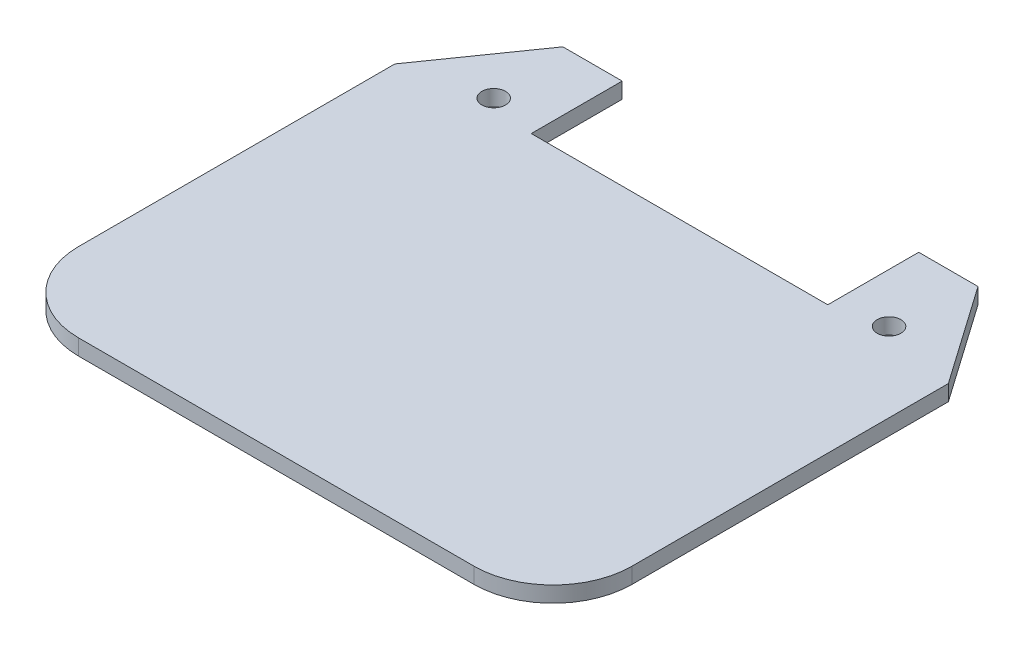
ISO-10303-21;
HEADER;
FILE_DESCRIPTION(('STEP AP214'),'2;1');
FILE_NAME('part.step','',(''),(''),'','','');
FILE_SCHEMA(('AUTOMOTIVE_DESIGN { 1 0 10303 214 1 1 1 1 }'));
ENDSEC;
DATA;
#1=APPLICATION_CONTEXT('core data for automotive mechanical design processes');
#2=APPLICATION_PROTOCOL_DEFINITION('international standard','automotive_design',2000,#1);
#3=PRODUCT_CONTEXT('',#1,'mechanical');
#4=PRODUCT('Part','Part','',(#3));
#5=PRODUCT_RELATED_PRODUCT_CATEGORY('part','',(#4));
#6=PRODUCT_DEFINITION_FORMATION('','',#4);
#7=PRODUCT_DEFINITION_CONTEXT('part definition',#1,'design');
#8=PRODUCT_DEFINITION('design','',#6,#7);
#9=PRODUCT_DEFINITION_SHAPE('','',#8);
#10=(LENGTH_UNIT() NAMED_UNIT(*) SI_UNIT(.MILLI.,.METRE.));
#11=(NAMED_UNIT(*) PLANE_ANGLE_UNIT() SI_UNIT($,.RADIAN.));
#12=(NAMED_UNIT(*) SI_UNIT($,.STERADIAN.) SOLID_ANGLE_UNIT());
#13=UNCERTAINTY_MEASURE_WITH_UNIT(LENGTH_MEASURE(1.E-05),#10,'distance_accuracy_value','');
#14=(GEOMETRIC_REPRESENTATION_CONTEXT(3) GLOBAL_UNCERTAINTY_ASSIGNED_CONTEXT((#13)) GLOBAL_UNIT_ASSIGNED_CONTEXT((#10,
#11,#12)) REPRESENTATION_CONTEXT('',''));
#15=CARTESIAN_POINT('',(0.,0.,0.));
#16=DIRECTION('',(0.,0.,1.));
#17=DIRECTION('',(1.,0.,0.));
#18=AXIS2_PLACEMENT_3D('',#15,#16,#17);
#19=CARTESIAN_POINT('',(5.24948115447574,0.4,-6.25));
#20=DIRECTION('',(0.,0.,1.));
#21=DIRECTION('',(1.,0.,0.));
#22=AXIS2_PLACEMENT_3D('',#19,#20,#21);
#23=PLANE('',#22);
#24=DIRECTION('',(-1.,0.,0.));
#25=VECTOR('',#24,1.);
#26=CARTESIAN_POINT('',(5.24948115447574,0.,-6.25));
#27=LINE('',#26,#25);
#28=CARTESIAN_POINT('',(5.24948115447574,0.,-6.25));
#29=VERTEX_POINT('',#28);
#30=CARTESIAN_POINT('',(3.75,0.,-6.25));
#31=VERTEX_POINT('',#30);
#32=EDGE_CURVE('E147',#29,#31,#27,.T.);
#33=ORIENTED_EDGE('',*,*,#32,.T.);
#34=DIRECTION('',(0.,1.,0.));
#35=VECTOR('',#34,1.);
#36=CARTESIAN_POINT('',(3.75,-9.6,-6.25));
#37=LINE('',#36,#35);
#38=CARTESIAN_POINT('',(3.75,0.4,-6.25));
#39=VERTEX_POINT('',#38);
#40=EDGE_CURVE('E131',#31,#39,#37,.T.);
#41=ORIENTED_EDGE('',*,*,#40,.T.);
#42=DIRECTION('',(-1.,0.,0.));
#43=VECTOR('',#42,1.);
#44=CARTESIAN_POINT('',(5.24948115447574,0.4,-6.25));
#45=LINE('',#44,#43);
#46=CARTESIAN_POINT('',(5.24948115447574,0.4,-6.25));
#47=VERTEX_POINT('',#46);
#48=EDGE_CURVE('E145',#47,#39,#45,.T.);
#49=ORIENTED_EDGE('',*,*,#48,.F.);
#50=DIRECTION('',(0.,-1.,0.));
#51=VECTOR('',#50,1.);
#52=CARTESIAN_POINT('',(5.24948115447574,0.4,-6.25));
#53=LINE('',#52,#51);
#54=EDGE_CURVE('E183',#47,#29,#53,.T.);
#55=ORIENTED_EDGE('',*,*,#54,.T.);
#56=EDGE_LOOP('',(#33,#41,#49,#55));
#57=FACE_BOUND('',#56,.T.);
#58=ADVANCED_FACE('F37',(#57),#23,.F.);
#59=CARTESIAN_POINT('',(-7.,0.4,-3.75));
#60=DIRECTION('',(1.,0.,0.));
#61=DIRECTION('',(0.,0.,-1.));
#62=AXIS2_PLACEMENT_3D('',#59,#60,#61);
#63=PLANE('',#62);
#64=DIRECTION('',(0.,0.,1.));
#65=VECTOR('',#64,1.);
#66=CARTESIAN_POINT('',(-7.,0.,-3.75));
#67=LINE('',#66,#65);
#68=CARTESIAN_POINT('',(-7.,0.,-3.75));
#69=VERTEX_POINT('',#68);
#70=CARTESIAN_POINT('',(-7.,0.,4.25));
#71=VERTEX_POINT('',#70);
#72=EDGE_CURVE('E163',#69,#71,#67,.T.);
#73=ORIENTED_EDGE('',*,*,#72,.T.);
#74=DIRECTION('',(0.,-1.,0.));
#75=VECTOR('',#74,1.);
#76=CARTESIAN_POINT('',(-7.,0.4,4.25));
#77=LINE('',#76,#75);
#78=CARTESIAN_POINT('',(-7.,0.4,4.25));
#79=VERTEX_POINT('',#78);
#80=EDGE_CURVE('E60',#71,#79,#77,.F.);
#81=ORIENTED_EDGE('',*,*,#80,.T.);
#82=DIRECTION('',(0.,0.,1.));
#83=VECTOR('',#82,1.);
#84=CARTESIAN_POINT('',(-7.,0.4,-3.75));
#85=LINE('',#84,#83);
#86=CARTESIAN_POINT('',(-7.,0.4,-3.75));
#87=VERTEX_POINT('',#86);
#88=EDGE_CURVE('E177',#87,#79,#85,.T.);
#89=ORIENTED_EDGE('',*,*,#88,.F.);
#90=DIRECTION('',(0.,-1.,0.));
#91=VECTOR('',#90,1.);
#92=CARTESIAN_POINT('',(-7.,0.4,-3.75));
#93=LINE('',#92,#91);
#94=EDGE_CURVE('E158',#87,#69,#93,.T.);
#95=ORIENTED_EDGE('',*,*,#94,.T.);
#96=EDGE_LOOP('',(#73,#81,#89,#95));
#97=FACE_BOUND('',#96,.T.);
#98=ADVANCED_FACE('F227',(#97),#63,.F.);
#99=CARTESIAN_POINT('',(-7.,0.4,6.25));
#100=DIRECTION('',(0.,0.,-1.));
#101=DIRECTION('',(-1.,0.,0.));
#102=AXIS2_PLACEMENT_3D('',#99,#100,#101);
#103=PLANE('',#102);
#104=DIRECTION('',(1.,0.,0.));
#105=VECTOR('',#104,1.);
#106=CARTESIAN_POINT('',(-7.,0.4,6.25));
#107=LINE('',#106,#105);
#108=CARTESIAN_POINT('',(-5.,0.4,6.25));
#109=VERTEX_POINT('',#108);
#110=CARTESIAN_POINT('',(5.,0.4,6.25));
#111=VERTEX_POINT('',#110);
#112=EDGE_CURVE('E213',#109,#111,#107,.T.);
#113=ORIENTED_EDGE('',*,*,#112,.F.);
#114=DIRECTION('',(0.,-1.,0.));
#115=VECTOR('',#114,1.);
#116=CARTESIAN_POINT('',(-5.,0.4,6.25));
#117=LINE('',#116,#115);
#118=CARTESIAN_POINT('',(-5.,0.,6.25));
#119=VERTEX_POINT('',#118);
#120=EDGE_CURVE('E203',#109,#119,#117,.T.);
#121=ORIENTED_EDGE('',*,*,#120,.T.);
#122=DIRECTION('',(1.,0.,0.));
#123=VECTOR('',#122,1.);
#124=CARTESIAN_POINT('',(-7.,0.,6.25));
#125=LINE('',#124,#123);
#126=CARTESIAN_POINT('',(5.,0.,6.25));
#127=VERTEX_POINT('',#126);
#128=EDGE_CURVE('E165',#119,#127,#125,.T.);
#129=ORIENTED_EDGE('',*,*,#128,.T.);
#130=DIRECTION('',(0.,-1.,0.));
#131=VECTOR('',#130,1.);
#132=CARTESIAN_POINT('',(5.,0.4,6.25));
#133=LINE('',#132,#131);
#134=EDGE_CURVE('E196',#127,#111,#133,.F.);
#135=ORIENTED_EDGE('',*,*,#134,.T.);
#136=EDGE_LOOP('',(#113,#121,#129,#135));
#137=FACE_BOUND('',#136,.T.);
#138=ADVANCED_FACE('F217',(#137),#103,.F.);
#139=CARTESIAN_POINT('',(7.,0.4,-3.75000000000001));
#140=DIRECTION('',(-1.,0.,0.));
#141=DIRECTION('',(0.,0.,1.));
#142=AXIS2_PLACEMENT_3D('',#139,#140,#141);
#143=PLANE('',#142);
#144=DIRECTION('',(0.,0.,-1.));
#145=VECTOR('',#144,1.);
#146=CARTESIAN_POINT('',(7.,0.4,-3.75000000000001));
#147=LINE('',#146,#145);
#148=CARTESIAN_POINT('',(7.,0.4,4.25));
#149=VERTEX_POINT('',#148);
#150=CARTESIAN_POINT('',(7.,0.4,-3.75000000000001));
#151=VERTEX_POINT('',#150);
#152=EDGE_CURVE('E220',#149,#151,#147,.T.);
#153=ORIENTED_EDGE('',*,*,#152,.F.);
#154=DIRECTION('',(0.,-1.,0.));
#155=VECTOR('',#154,1.);
#156=CARTESIAN_POINT('',(7.,0.4,4.25));
#157=LINE('',#156,#155);
#158=CARTESIAN_POINT('',(7.,0.,4.25));
#159=VERTEX_POINT('',#158);
#160=EDGE_CURVE('E11',#149,#159,#157,.T.);
#161=ORIENTED_EDGE('',*,*,#160,.T.);
#162=DIRECTION('',(0.,0.,-1.));
#163=VECTOR('',#162,1.);
#164=CARTESIAN_POINT('',(7.,0.,-3.75000000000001));
#165=LINE('',#164,#163);
#166=CARTESIAN_POINT('',(7.,0.,-3.75000000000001));
#167=VERTEX_POINT('',#166);
#168=EDGE_CURVE('E169',#159,#167,#165,.T.);
#169=ORIENTED_EDGE('',*,*,#168,.T.);
#170=DIRECTION('',(0.,-1.,0.));
#171=VECTOR('',#170,1.);
#172=CARTESIAN_POINT('',(7.,0.4,-3.75000000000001));
#173=LINE('',#172,#171);
#174=EDGE_CURVE('E185',#151,#167,#173,.T.);
#175=ORIENTED_EDGE('',*,*,#174,.F.);
#176=EDGE_LOOP('',(#153,#161,#169,#175));
#177=FACE_BOUND('',#176,.T.);
#178=ADVANCED_FACE('F249',(#177),#143,.F.);
#179=CARTESIAN_POINT('',(7.,0.4,-3.75000000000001));
#180=DIRECTION('',(-0.819152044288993,0.,0.573576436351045));
#181=DIRECTION('',(0.573576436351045,0.,0.819152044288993));
#182=AXIS2_PLACEMENT_3D('',#179,#180,#181);
#183=PLANE('',#182);
#184=DIRECTION('',(-0.573576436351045,0.,-0.819152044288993));
#185=VECTOR('',#184,1.);
#186=CARTESIAN_POINT('',(7.,0.,-3.75000000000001));
#187=LINE('',#186,#185);
#188=EDGE_CURVE('E171',#167,#29,#187,.T.);
#189=ORIENTED_EDGE('',*,*,#188,.T.);
#190=ORIENTED_EDGE('',*,*,#54,.F.);
#191=DIRECTION('',(-0.573576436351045,0.,-0.819152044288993));
#192=VECTOR('',#191,1.);
#193=CARTESIAN_POINT('',(7.,0.4,-3.75000000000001));
#194=LINE('',#193,#192);
#195=EDGE_CURVE('E153',#151,#47,#194,.T.);
#196=ORIENTED_EDGE('',*,*,#195,.F.);
#197=ORIENTED_EDGE('',*,*,#174,.T.);
#198=EDGE_LOOP('',(#189,#190,#196,#197));
#199=FACE_BOUND('',#198,.T.);
#200=ADVANCED_FACE('F253',(#199),#183,.F.);
#201=CARTESIAN_POINT('',(-3.75,0.4,-6.25));
#202=VERTEX_POINT('',#201);
#203=CARTESIAN_POINT('',(-5.24948115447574,0.4,-6.25));
#204=VERTEX_POINT('',#203);
#205=EDGE_CURVE('E156',#202,#204,#45,.T.);
#206=ORIENTED_EDGE('',*,*,#205,.F.);
#207=DIRECTION('',(0.,1.,0.));
#208=VECTOR('',#207,1.);
#209=CARTESIAN_POINT('',(-3.75,-9.6,-6.25));
#210=LINE('',#209,#208);
#211=CARTESIAN_POINT('',(-3.75,0.,-6.25));
#212=VERTEX_POINT('',#211);
#213=EDGE_CURVE('E148',#212,#202,#210,.T.);
#214=ORIENTED_EDGE('',*,*,#213,.F.);
#215=CARTESIAN_POINT('',(-5.24948115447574,0.,-6.25));
#216=VERTEX_POINT('',#215);
#217=EDGE_CURVE('E173',#212,#216,#27,.T.);
#218=ORIENTED_EDGE('',*,*,#217,.T.);
#219=DIRECTION('',(0.,-1.,0.));
#220=VECTOR('',#219,1.);
#221=CARTESIAN_POINT('',(-5.24948115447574,0.4,-6.25));
#222=LINE('',#221,#220);
#223=EDGE_CURVE('E180',#204,#216,#222,.T.);
#224=ORIENTED_EDGE('',*,*,#223,.F.);
#225=EDGE_LOOP('',(#206,#214,#218,#224));
#226=FACE_BOUND('',#225,.T.);
#227=ADVANCED_FACE('F237',(#226),#23,.F.);
#228=CARTESIAN_POINT('',(-5.24948115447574,0.4,-6.25));
#229=DIRECTION('',(0.819152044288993,0.,0.573576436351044));
#230=DIRECTION('',(0.573576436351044,0.,-0.819152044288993));
#231=AXIS2_PLACEMENT_3D('',#228,#229,#230);
#232=PLANE('',#231);
#233=DIRECTION('',(-0.573576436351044,0.,0.819152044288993));
#234=VECTOR('',#233,1.);
#235=CARTESIAN_POINT('',(-5.24948115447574,0.,-6.25));
#236=LINE('',#235,#234);
#237=EDGE_CURVE('E175',#216,#69,#236,.T.);
#238=ORIENTED_EDGE('',*,*,#237,.T.);
#239=ORIENTED_EDGE('',*,*,#94,.F.);
#240=DIRECTION('',(-0.573576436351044,0.,0.819152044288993));
#241=VECTOR('',#240,1.);
#242=CARTESIAN_POINT('',(-5.24948115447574,0.4,-6.25));
#243=LINE('',#242,#241);
#244=EDGE_CURVE('E155',#204,#87,#243,.T.);
#245=ORIENTED_EDGE('',*,*,#244,.F.);
#246=ORIENTED_EDGE('',*,*,#223,.T.);
#247=EDGE_LOOP('',(#238,#239,#245,#246));
#248=FACE_BOUND('',#247,.T.);
#249=ADVANCED_FACE('F231',(#248),#232,.F.);
#250=CARTESIAN_POINT('',(0.,0.4,0.));
#251=DIRECTION('',(0.,1.,0.));
#252=DIRECTION('',(0.,0.,1.));
#253=AXIS2_PLACEMENT_3D('',#250,#251,#252);
#254=PLANE('',#253);
#255=CARTESIAN_POINT('',(5.,0.4,-4.25));
#256=DIRECTION('',(0.,1.,0.));
#257=DIRECTION('',(0.,0.,1.));
#258=AXIS2_PLACEMENT_3D('',#255,#256,#257);
#259=CIRCLE('',#258,0.3);
#260=CARTESIAN_POINT('',(5.,0.4,-3.95));
#261=VERTEX_POINT('',#260);
#262=EDGE_CURVE('E260',#261,#261,#259,.T.);
#263=ORIENTED_EDGE('',*,*,#262,.F.);
#264=EDGE_LOOP('',(#263));
#265=FACE_BOUND('',#264,.T.);
#266=CARTESIAN_POINT('',(-5.,0.4,-4.25));
#267=DIRECTION('',(0.,1.,0.));
#268=DIRECTION('',(0.,0.,1.));
#269=AXIS2_PLACEMENT_3D('',#266,#267,#268);
#270=CIRCLE('',#269,0.3);
#271=CARTESIAN_POINT('',(-5.,0.4,-3.95));
#272=VERTEX_POINT('',#271);
#273=EDGE_CURVE('E139',#272,#272,#270,.T.);
#274=ORIENTED_EDGE('',*,*,#273,.F.);
#275=EDGE_LOOP('',(#274));
#276=FACE_BOUND('',#275,.T.);
#277=ORIENTED_EDGE('',*,*,#88,.T.);
#278=CARTESIAN_POINT('',(-5.,0.4,4.25));
#279=DIRECTION('',(0.,1.,0.));
#280=DIRECTION('',(0.,0.,1.));
#281=AXIS2_PLACEMENT_3D('',#278,#279,#280);
#282=CIRCLE('',#281,2.);
#283=EDGE_CURVE('E45',#79,#109,#282,.T.);
#284=ORIENTED_EDGE('',*,*,#283,.T.);
#285=ORIENTED_EDGE('',*,*,#112,.T.);
#286=CARTESIAN_POINT('',(5.,0.4,4.25));
#287=DIRECTION('',(0.,1.,0.));
#288=DIRECTION('',(0.,0.,1.));
#289=AXIS2_PLACEMENT_3D('',#286,#287,#288);
#290=CIRCLE('',#289,2.);
#291=EDGE_CURVE('E52',#111,#149,#290,.T.);
#292=ORIENTED_EDGE('',*,*,#291,.T.);
#293=ORIENTED_EDGE('',*,*,#152,.T.);
#294=ORIENTED_EDGE('',*,*,#195,.T.);
#295=ORIENTED_EDGE('',*,*,#48,.T.);
#296=DIRECTION('',(0.,0.,-1.));
#297=VECTOR('',#296,1.);
#298=CARTESIAN_POINT('',(3.75,0.4,-6.25));
#299=LINE('',#298,#297);
#300=CARTESIAN_POINT('',(3.75,0.4,-3.95));
#301=VERTEX_POINT('',#300);
#302=EDGE_CURVE('E128',#301,#39,#299,.T.);
#303=ORIENTED_EDGE('',*,*,#302,.F.);
#304=DIRECTION('',(1.,0.,0.));
#305=VECTOR('',#304,1.);
#306=CARTESIAN_POINT('',(3.75,0.4,-3.95));
#307=LINE('',#306,#305);
#308=CARTESIAN_POINT('',(-3.75,0.4,-3.95));
#309=VERTEX_POINT('',#308);
#310=EDGE_CURVE('E149',#309,#301,#307,.T.);
#311=ORIENTED_EDGE('',*,*,#310,.F.);
#312=DIRECTION('',(0.,0.,1.));
#313=VECTOR('',#312,1.);
#314=CARTESIAN_POINT('',(-3.75,0.4,-6.25));
#315=LINE('',#314,#313);
#316=EDGE_CURVE('E138',#202,#309,#315,.T.);
#317=ORIENTED_EDGE('',*,*,#316,.F.);
#318=ORIENTED_EDGE('',*,*,#205,.T.);
#319=ORIENTED_EDGE('',*,*,#244,.T.);
#320=EDGE_LOOP('',(#277,#284,#285,#292,#293,#294,#295,#303,#311,#317,#318,#319));
#321=FACE_BOUND('',#320,.T.);
#322=ADVANCED_FACE('F151',(#265,#276,#321),#254,.T.);
#323=CARTESIAN_POINT('',(0.,0.,0.));
#324=DIRECTION('',(0.,1.,0.));
#325=DIRECTION('',(0.,0.,1.));
#326=AXIS2_PLACEMENT_3D('',#323,#324,#325);
#327=PLANE('',#326);
#328=CARTESIAN_POINT('',(5.,0.,-4.25));
#329=DIRECTION('',(0.,1.,0.));
#330=DIRECTION('',(0.,0.,1.));
#331=AXIS2_PLACEMENT_3D('',#328,#329,#330);
#332=CIRCLE('',#331,0.3);
#333=CARTESIAN_POINT('',(5.,0.,-3.95));
#334=VERTEX_POINT('',#333);
#335=EDGE_CURVE('E166',#334,#334,#332,.T.);
#336=ORIENTED_EDGE('',*,*,#335,.T.);
#337=EDGE_LOOP('',(#336));
#338=FACE_BOUND('',#337,.T.);
#339=CARTESIAN_POINT('',(-5.,0.,-4.25));
#340=DIRECTION('',(0.,1.,0.));
#341=DIRECTION('',(0.,0.,1.));
#342=AXIS2_PLACEMENT_3D('',#339,#340,#341);
#343=CIRCLE('',#342,0.3);
#344=CARTESIAN_POINT('',(-5.,0.,-3.95));
#345=VERTEX_POINT('',#344);
#346=EDGE_CURVE('E197',#345,#345,#343,.T.);
#347=ORIENTED_EDGE('',*,*,#346,.T.);
#348=EDGE_LOOP('',(#347));
#349=FACE_BOUND('',#348,.T.);
#350=ORIENTED_EDGE('',*,*,#128,.F.);
#351=CARTESIAN_POINT('',(-5.,0.,4.25));
#352=DIRECTION('',(0.,1.,0.));
#353=DIRECTION('',(0.,0.,1.));
#354=AXIS2_PLACEMENT_3D('',#351,#352,#353);
#355=CIRCLE('',#354,2.);
#356=EDGE_CURVE('E208',#119,#71,#355,.F.);
#357=ORIENTED_EDGE('',*,*,#356,.T.);
#358=ORIENTED_EDGE('',*,*,#72,.F.);
#359=ORIENTED_EDGE('',*,*,#237,.F.);
#360=ORIENTED_EDGE('',*,*,#217,.F.);
#361=DIRECTION('',(0.,0.,1.));
#362=VECTOR('',#361,1.);
#363=CARTESIAN_POINT('',(-3.75,0.,0.));
#364=LINE('',#363,#362);
#365=CARTESIAN_POINT('',(-3.75,0.,-3.95));
#366=VERTEX_POINT('',#365);
#367=EDGE_CURVE('E188',#212,#366,#364,.T.);
#368=ORIENTED_EDGE('',*,*,#367,.T.);
#369=DIRECTION('',(1.,0.,0.));
#370=VECTOR('',#369,1.);
#371=CARTESIAN_POINT('',(0.,0.,-3.95));
#372=LINE('',#371,#370);
#373=CARTESIAN_POINT('',(3.75,0.,-3.95));
#374=VERTEX_POINT('',#373);
#375=EDGE_CURVE('E191',#366,#374,#372,.T.);
#376=ORIENTED_EDGE('',*,*,#375,.T.);
#377=DIRECTION('',(0.,0.,-1.));
#378=VECTOR('',#377,1.);
#379=CARTESIAN_POINT('',(3.75,0.,0.));
#380=LINE('',#379,#378);
#381=EDGE_CURVE('E194',#374,#31,#380,.T.);
#382=ORIENTED_EDGE('',*,*,#381,.T.);
#383=ORIENTED_EDGE('',*,*,#32,.F.);
#384=ORIENTED_EDGE('',*,*,#188,.F.);
#385=ORIENTED_EDGE('',*,*,#168,.F.);
#386=CARTESIAN_POINT('',(5.,0.,4.25));
#387=DIRECTION('',(0.,1.,0.));
#388=DIRECTION('',(0.,0.,1.));
#389=AXIS2_PLACEMENT_3D('',#386,#387,#388);
#390=CIRCLE('',#389,2.);
#391=EDGE_CURVE('E206',#159,#127,#390,.F.);
#392=ORIENTED_EDGE('',*,*,#391,.T.);
#393=EDGE_LOOP('',(#350,#357,#358,#359,#360,#368,#376,#382,#383,#384,#385,#392));
#394=FACE_BOUND('',#393,.T.);
#395=ADVANCED_FACE('F225',(#338,#349,#394),#327,.F.);
#396=CARTESIAN_POINT('',(3.75,-9.6,-6.25));
#397=DIRECTION('',(1.,0.,0.));
#398=DIRECTION('',(0.,0.,-1.));
#399=AXIS2_PLACEMENT_3D('',#396,#397,#398);
#400=PLANE('',#399);
#401=DIRECTION('',(0.,1.,0.));
#402=VECTOR('',#401,1.);
#403=CARTESIAN_POINT('',(3.75,-9.6,-3.95));
#404=LINE('',#403,#402);
#405=EDGE_CURVE('E134',#374,#301,#404,.T.);
#406=ORIENTED_EDGE('',*,*,#405,.T.);
#407=ORIENTED_EDGE('',*,*,#302,.T.);
#408=ORIENTED_EDGE('',*,*,#40,.F.);
#409=ORIENTED_EDGE('',*,*,#381,.F.);
#410=EDGE_LOOP('',(#406,#407,#408,#409));
#411=FACE_BOUND('',#410,.T.);
#412=ADVANCED_FACE('F130',(#411),#400,.F.);
#413=CARTESIAN_POINT('',(3.75,-9.6,-3.95));
#414=DIRECTION('',(0.,0.,1.));
#415=DIRECTION('',(1.,0.,0.));
#416=AXIS2_PLACEMENT_3D('',#413,#414,#415);
#417=PLANE('',#416);
#418=DIRECTION('',(0.,1.,0.));
#419=VECTOR('',#418,1.);
#420=CARTESIAN_POINT('',(-3.75,-9.6,-3.95));
#421=LINE('',#420,#419);
#422=EDGE_CURVE('E241',#366,#309,#421,.T.);
#423=ORIENTED_EDGE('',*,*,#422,.T.);
#424=ORIENTED_EDGE('',*,*,#310,.T.);
#425=ORIENTED_EDGE('',*,*,#405,.F.);
#426=ORIENTED_EDGE('',*,*,#375,.F.);
#427=EDGE_LOOP('',(#423,#424,#425,#426));
#428=FACE_BOUND('',#427,.T.);
#429=ADVANCED_FACE('F256',(#428),#417,.F.);
#430=CARTESIAN_POINT('',(-3.75,-9.6,-6.25));
#431=DIRECTION('',(-1.,0.,0.));
#432=DIRECTION('',(0.,0.,1.));
#433=AXIS2_PLACEMENT_3D('',#430,#431,#432);
#434=PLANE('',#433);
#435=ORIENTED_EDGE('',*,*,#213,.T.);
#436=ORIENTED_EDGE('',*,*,#316,.T.);
#437=ORIENTED_EDGE('',*,*,#422,.F.);
#438=ORIENTED_EDGE('',*,*,#367,.F.);
#439=EDGE_LOOP('',(#435,#436,#437,#438));
#440=FACE_BOUND('',#439,.T.);
#441=ADVANCED_FACE('F310',(#440),#434,.F.);
#442=CARTESIAN_POINT('',(-5.,-9.6,-4.25));
#443=DIRECTION('',(0.,1.,0.));
#444=DIRECTION('',(0.,0.,1.));
#445=AXIS2_PLACEMENT_3D('',#442,#443,#444);
#446=CYLINDRICAL_SURFACE('',#445,0.3);
#447=ORIENTED_EDGE('',*,*,#273,.T.);
#448=EDGE_LOOP('',(#447));
#449=FACE_BOUND('',#448,.T.);
#450=ORIENTED_EDGE('',*,*,#346,.F.);
#451=EDGE_LOOP('',(#450));
#452=FACE_BOUND('',#451,.T.);
#453=ADVANCED_FACE('F266',(#449,#452),#446,.F.);
#454=CARTESIAN_POINT('',(5.,-9.6,-4.25));
#455=DIRECTION('',(0.,1.,0.));
#456=DIRECTION('',(0.,0.,1.));
#457=AXIS2_PLACEMENT_3D('',#454,#455,#456);
#458=CYLINDRICAL_SURFACE('',#457,0.3);
#459=ORIENTED_EDGE('',*,*,#262,.T.);
#460=EDGE_LOOP('',(#459));
#461=FACE_BOUND('',#460,.T.);
#462=ORIENTED_EDGE('',*,*,#335,.F.);
#463=EDGE_LOOP('',(#462));
#464=FACE_BOUND('',#463,.T.);
#465=ADVANCED_FACE('F299',(#461,#464),#458,.F.);
#466=CARTESIAN_POINT('',(-5.,0.4,4.25));
#467=DIRECTION('',(0.,-1.,0.));
#468=DIRECTION('',(0.,0.,-1.));
#469=AXIS2_PLACEMENT_3D('',#466,#467,#468);
#470=CYLINDRICAL_SURFACE('',#469,2.);
#471=ORIENTED_EDGE('',*,*,#283,.F.);
#472=ORIENTED_EDGE('',*,*,#80,.F.);
#473=ORIENTED_EDGE('',*,*,#356,.F.);
#474=ORIENTED_EDGE('',*,*,#120,.F.);
#475=EDGE_LOOP('',(#471,#472,#473,#474));
#476=FACE_BOUND('',#475,.T.);
#477=ADVANCED_FACE('F222',(#476),#470,.T.);
#478=CARTESIAN_POINT('',(5.,0.4,4.25));
#479=DIRECTION('',(0.,-1.,0.));
#480=DIRECTION('',(0.,0.,-1.));
#481=AXIS2_PLACEMENT_3D('',#478,#479,#480);
#482=CYLINDRICAL_SURFACE('',#481,2.);
#483=ORIENTED_EDGE('',*,*,#291,.F.);
#484=ORIENTED_EDGE('',*,*,#134,.F.);
#485=ORIENTED_EDGE('',*,*,#391,.F.);
#486=ORIENTED_EDGE('',*,*,#160,.F.);
#487=EDGE_LOOP('',(#483,#484,#485,#486));
#488=FACE_BOUND('',#487,.T.);
#489=ADVANCED_FACE('F39',(#488),#482,.T.);
#490=CLOSED_SHELL('',(#58,#98,#138,#178,#200,#227,#249,#322,#395,#412,#429,#441,#453,#465,#477,#489));
#491=MANIFOLD_SOLID_BREP('B2',#490);
#492=ADVANCED_BREP_SHAPE_REPRESENTATION('',(#18,#491),#14);
#493=SHAPE_DEFINITION_REPRESENTATION(#9,#492);
ENDSEC;
END-ISO-10303-21;
